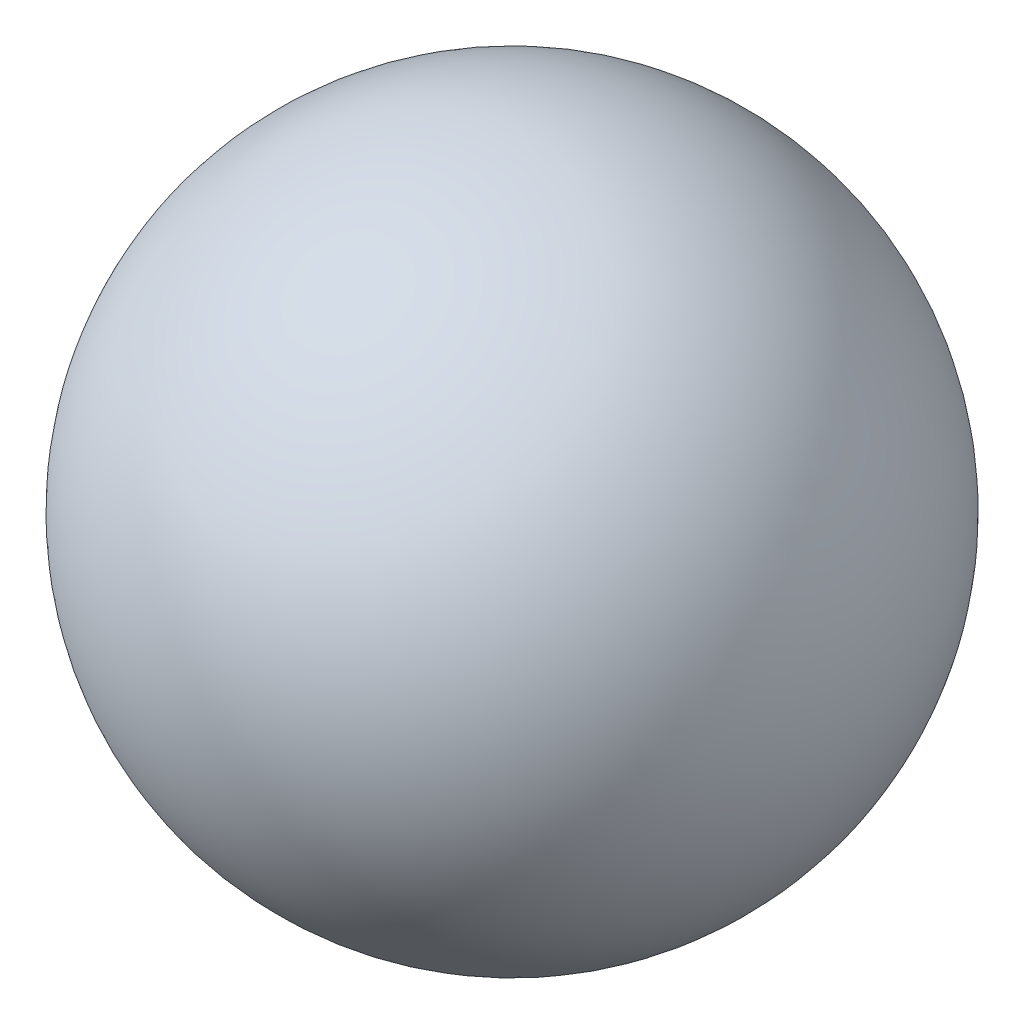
from build123d import *


with BuildPart() as part:
    # Esquisse1 → Base-R_volution (revolve)
    with BuildSketch(Plane(origin=(0, 0, 0), x_dir=(1, 0, 0), z_dir=(0, 1, 0))):
        with BuildLine():
            Line((0.9, 2.7), (4.5, 2.7))
            ThreePointArc((4.5, 2.7), (2.7, 4.5), (0.9, 2.7))
        make_face()
    revolve(axis=Axis((-0.3, 0, -2.7), (1, 0, 0)))


solid = part.part
